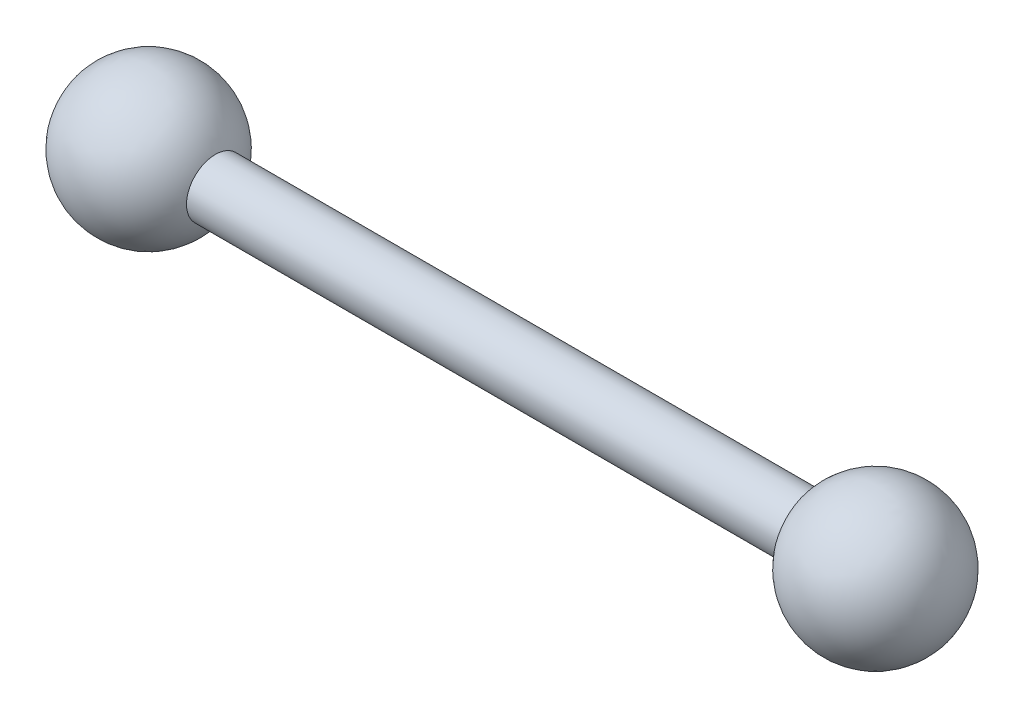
ISO-10303-21;
HEADER;
FILE_DESCRIPTION(('STEP AP214'),'2;1');
FILE_NAME('part.step','',(''),(''),'','','');
FILE_SCHEMA(('AUTOMOTIVE_DESIGN { 1 0 10303 214 1 1 1 1 }'));
ENDSEC;
DATA;
#1=APPLICATION_CONTEXT('core data for automotive mechanical design processes');
#2=APPLICATION_PROTOCOL_DEFINITION('international standard','automotive_design',2000,#1);
#3=PRODUCT_CONTEXT('',#1,'mechanical');
#4=PRODUCT('Part','Part','',(#3));
#5=PRODUCT_RELATED_PRODUCT_CATEGORY('part','',(#4));
#6=PRODUCT_DEFINITION_FORMATION('','',#4);
#7=PRODUCT_DEFINITION_CONTEXT('part definition',#1,'design');
#8=PRODUCT_DEFINITION('design','',#6,#7);
#9=PRODUCT_DEFINITION_SHAPE('','',#8);
#10=(LENGTH_UNIT() NAMED_UNIT(*) SI_UNIT(.MILLI.,.METRE.));
#11=(NAMED_UNIT(*) PLANE_ANGLE_UNIT() SI_UNIT($,.RADIAN.));
#12=(NAMED_UNIT(*) SI_UNIT($,.STERADIAN.) SOLID_ANGLE_UNIT());
#13=UNCERTAINTY_MEASURE_WITH_UNIT(LENGTH_MEASURE(1.E-05),#10,'distance_accuracy_value','');
#14=(GEOMETRIC_REPRESENTATION_CONTEXT(3) GLOBAL_UNCERTAINTY_ASSIGNED_CONTEXT((#13)) GLOBAL_UNIT_ASSIGNED_CONTEXT((#10,
#11,#12)) REPRESENTATION_CONTEXT('',''));
#15=CARTESIAN_POINT('',(0.,0.,0.));
#16=DIRECTION('',(0.,0.,1.));
#17=DIRECTION('',(1.,0.,0.));
#18=AXIS2_PLACEMENT_3D('',#15,#16,#17);
#19=CARTESIAN_POINT('',(0.,0.,0.));
#20=DIRECTION('',(-1.,0.,0.));
#21=DIRECTION('',(0.,1.,0.));
#22=AXIS2_PLACEMENT_3D('',#19,#20,#21);
#23=SPHERICAL_SURFACE('',#22,5.);
#24=CARTESIAN_POINT('',(4.59044617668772,0.,0.));
#25=DIRECTION('',(-1.,0.,0.));
#26=DIRECTION('',(0.,0.,1.));
#27=AXIS2_PLACEMENT_3D('',#24,#25,#26);
#28=CIRCLE('',#27,1.98186878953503);
#29=CARTESIAN_POINT('',(4.59044617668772,0.,1.98186878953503));
#30=VERTEX_POINT('',#29);
#31=EDGE_CURVE('E35',#30,#30,#28,.T.);
#32=ORIENTED_EDGE('',*,*,#31,.T.);
#33=EDGE_LOOP('',(#32));
#34=FACE_BOUND('',#33,.T.);
#35=ADVANCED_FACE('F29',(#34),#23,.T.);
#36=CARTESIAN_POINT('',(50.,0.,0.));
#37=DIRECTION('',(-1.,0.,0.));
#38=DIRECTION('',(0.,1.,0.));
#39=AXIS2_PLACEMENT_3D('',#36,#37,#38);
#40=SPHERICAL_SURFACE('',#39,5.);
#41=CARTESIAN_POINT('',(45.4095538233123,0.,0.));
#42=DIRECTION('',(-1.,0.,0.));
#43=DIRECTION('',(0.,0.,1.));
#44=AXIS2_PLACEMENT_3D('',#41,#42,#43);
#45=CIRCLE('',#44,1.98186878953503);
#46=CARTESIAN_POINT('',(45.4095538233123,0.,1.98186878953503));
#47=VERTEX_POINT('',#46);
#48=EDGE_CURVE('E10',#47,#47,#45,.T.);
#49=ORIENTED_EDGE('',*,*,#48,.F.);
#50=EDGE_LOOP('',(#49));
#51=FACE_BOUND('',#50,.T.);
#52=ADVANCED_FACE('F44',(#51),#40,.T.);
#53=CARTESIAN_POINT('',(-16.7296084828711,0.,0.));
#54=DIRECTION('',(-1.,0.,0.));
#55=DIRECTION('',(0.,0.,1.));
#56=AXIS2_PLACEMENT_3D('',#53,#54,#55);
#57=CYLINDRICAL_SURFACE('',#56,1.98186878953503);
#58=ORIENTED_EDGE('',*,*,#31,.F.);
#59=EDGE_LOOP('',(#58));
#60=FACE_BOUND('',#59,.T.);
#61=ORIENTED_EDGE('',*,*,#48,.T.);
#62=EDGE_LOOP('',(#61));
#63=FACE_BOUND('',#62,.T.);
#64=ADVANCED_FACE('F42',(#60,#63),#57,.T.);
#65=CLOSED_SHELL('',(#35,#52,#64));
#66=MANIFOLD_SOLID_BREP('B2',#65);
#67=ADVANCED_BREP_SHAPE_REPRESENTATION('',(#18,#66),#14);
#68=SHAPE_DEFINITION_REPRESENTATION(#9,#67);
ENDSEC;
END-ISO-10303-21;
